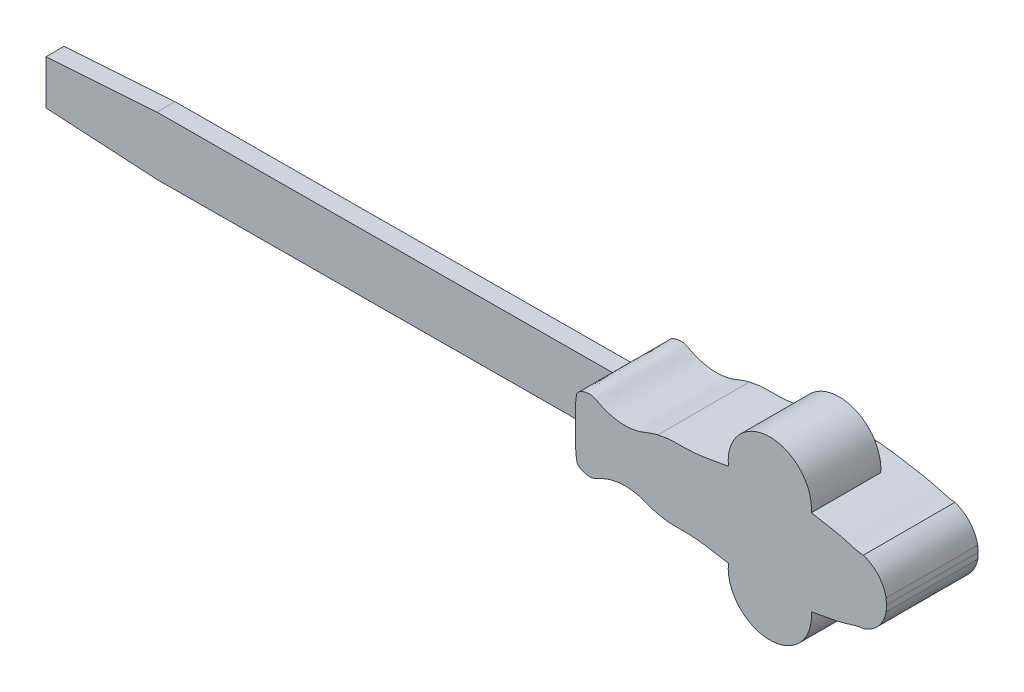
ISO-10303-21;
HEADER;
FILE_DESCRIPTION(('STEP AP214'),'2;1');
FILE_NAME('part.step','',(''),(''),'','','');
FILE_SCHEMA(('AUTOMOTIVE_DESIGN { 1 0 10303 214 1 1 1 1 }'));
ENDSEC;
DATA;
#1=APPLICATION_CONTEXT('core data for automotive mechanical design processes');
#2=APPLICATION_PROTOCOL_DEFINITION('international standard','automotive_design',2000,#1);
#3=PRODUCT_CONTEXT('',#1,'mechanical');
#4=PRODUCT('Part','Part','',(#3));
#5=PRODUCT_RELATED_PRODUCT_CATEGORY('part','',(#4));
#6=PRODUCT_DEFINITION_FORMATION('','',#4);
#7=PRODUCT_DEFINITION_CONTEXT('part definition',#1,'design');
#8=PRODUCT_DEFINITION('design','',#6,#7);
#9=PRODUCT_DEFINITION_SHAPE('','',#8);
#10=(LENGTH_UNIT() NAMED_UNIT(*) SI_UNIT(.MILLI.,.METRE.));
#11=(NAMED_UNIT(*) PLANE_ANGLE_UNIT() SI_UNIT($,.RADIAN.));
#12=(NAMED_UNIT(*) SI_UNIT($,.STERADIAN.) SOLID_ANGLE_UNIT());
#13=UNCERTAINTY_MEASURE_WITH_UNIT(LENGTH_MEASURE(1.E-05),#10,'distance_accuracy_value','');
#14=(GEOMETRIC_REPRESENTATION_CONTEXT(3) GLOBAL_UNCERTAINTY_ASSIGNED_CONTEXT((#13)) GLOBAL_UNIT_ASSIGNED_CONTEXT((#10,
#11,#12)) REPRESENTATION_CONTEXT('',''));
#15=CARTESIAN_POINT('',(0.,0.,0.));
#16=DIRECTION('',(0.,0.,1.));
#17=DIRECTION('',(1.,0.,0.));
#18=AXIS2_PLACEMENT_3D('',#15,#16,#17);
#19=CARTESIAN_POINT('',(5.05066941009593,-10.4757213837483,-3.25));
#20=DIRECTION('',(0.,0.,-1.));
#21=DIRECTION('',(-1.,0.,0.));
#22=AXIS2_PLACEMENT_3D('',#19,#20,#21);
#23=PLANE('',#22);
#24=DIRECTION('',(-0.999988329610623,-0.00483121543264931,0.));
#25=VECTOR('',#24,1.);
#26=CARTESIAN_POINT('',(5.05066941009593,-10.4757213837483,-3.25));
#27=LINE('',#26,#25);
#28=CARTESIAN_POINT('',(0.475948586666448,-10.4978231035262,-3.25));
#29=VERTEX_POINT('',#28);
#30=CARTESIAN_POINT('',(-163.946891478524,-11.2921945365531,-3.25));
#31=VERTEX_POINT('',#30);
#32=EDGE_CURVE('E233',#29,#31,#27,.T.);
#33=ORIENTED_EDGE('',*,*,#32,.T.);
#34=DIRECTION('',(-0.998342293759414,0.0575557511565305,0.));
#35=VECTOR('',#34,1.);
#36=CARTESIAN_POINT('',(4.44392236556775,-21.0001472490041,-3.25));
#37=LINE('',#36,#35);
#38=CARTESIAN_POINT('',(-203.958969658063,-8.985445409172,-3.25));
#39=VERTEX_POINT('',#38);
#40=EDGE_CURVE('E211',#31,#39,#37,.T.);
#41=ORIENTED_EDGE('',*,*,#40,.T.);
#42=DIRECTION('',(0.00483121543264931,-0.999988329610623,0.));
#43=VECTOR('',#42,1.);
#44=CARTESIAN_POINT('',(-203.946891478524,-11.485445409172,-3.25));
#45=LINE('',#44,#43);
#46=CARTESIAN_POINT('',(-204.036268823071,7.01430951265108,-3.25));
#47=VERTEX_POINT('',#46);
#48=EDGE_CURVE('E608',#47,#39,#45,.T.);
#49=ORIENTED_EDGE('',*,*,#48,.F.);
#50=DIRECTION('',(-0.997739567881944,-0.0671993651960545,0.));
#51=VECTOR('',#50,1.);
#52=CARTESIAN_POINT('',(2.93382184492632,20.9540781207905,-3.25));
#53=LINE('',#52,#51);
#54=CARTESIAN_POINT('',(-164.04834700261,9.70756038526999,-3.25));
#55=VERTEX_POINT('',#54);
#56=EDGE_CURVE('E65',#55,#47,#53,.T.);
#57=ORIENTED_EDGE('',*,*,#56,.F.);
#58=DIRECTION('',(-0.999988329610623,-0.00483121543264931,0.));
#59=VECTOR('',#58,1.);
#60=CARTESIAN_POINT('',(4.9492138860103,10.5240335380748,-3.25));
#61=LINE('',#60,#59);
#62=CARTESIAN_POINT('',(0.374493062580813,10.5019318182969,-3.25));
#63=VERTEX_POINT('',#62);
#64=EDGE_CURVE('E238',#63,#55,#61,.T.);
#65=ORIENTED_EDGE('',*,*,#64,.F.);
#66=CARTESIAN_POINT('',(-0.0328656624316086,3.40126746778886,-3.25));
#67=CARTESIAN_POINT('',(-0.224843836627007,7.16255319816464,-3.25));
#68=CARTESIAN_POINT('',(0.440236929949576,10.8822575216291,-3.25));
#69=B_SPLINE_CURVE_WITH_KNOTS('',2,(#66,#67,#68),.UNSPECIFIED.,.F.,.F.,(3,3),(0.,1.),.UNSPECIFIED.);
#70=CARTESIAN_POINT('',(-0.0328656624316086,3.40126746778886,-3.25));
#71=VERTEX_POINT('',#70);
#72=EDGE_CURVE('E271',#71,#63,#69,.T.);
#73=ORIENTED_EDGE('',*,*,#72,.F.);
#74=DIRECTION('',(-0.00966231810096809,0.999953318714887,0.));
#75=VECTOR('',#74,1.);
#76=CARTESIAN_POINT('',(0.,0.,-3.25));
#77=LINE('',#76,#75);
#78=CARTESIAN_POINT('',(0.,0.,-3.25));
#79=VERTEX_POINT('',#78);
#80=EDGE_CURVE('E585',#79,#71,#77,.T.);
#81=ORIENTED_EDGE('',*,*,#80,.F.);
#82=DIRECTION('',(0.,-1.,0.));
#83=VECTOR('',#82,1.);
#84=CARTESIAN_POINT('',(0.,0.,-3.25));
#85=LINE('',#84,#83);
#86=CARTESIAN_POINT('',(0.,-3.40142625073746,-3.25));
#87=VERTEX_POINT('',#86);
#88=EDGE_CURVE('E260',#79,#87,#85,.T.);
#89=ORIENTED_EDGE('',*,*,#88,.T.);
#90=CARTESIAN_POINT('',(0.,-3.40142625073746,-3.25));
#91=CARTESIAN_POINT('',(-0.15562647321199,-7.16439135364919,-3.25));
#92=CARTESIAN_POINT('',(0.545364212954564,-10.8774958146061,-3.25));
#93=B_SPLINE_CURVE_WITH_KNOTS('',2,(#90,#91,#92),.UNSPECIFIED.,.F.,.F.,(3,3),(0.,1.),.UNSPECIFIED.);
#94=EDGE_CURVE('E266',#87,#29,#93,.T.);
#95=ORIENTED_EDGE('',*,*,#94,.T.);
#96=EDGE_LOOP('',(#33,#41,#49,#57,#65,#73,#81,#89,#95));
#97=FACE_BOUND('',#96,.T.);
#98=ADVANCED_FACE('F41',(#97),#23,.T.);
#99=CARTESIAN_POINT('',(5.05066941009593,-10.4757213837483,3.25));
#100=DIRECTION('',(0.,0.,1.));
#101=DIRECTION('',(1.,0.,0.));
#102=AXIS2_PLACEMENT_3D('',#99,#100,#101);
#103=PLANE('',#102);
#104=DIRECTION('',(-0.00483121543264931,0.999988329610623,0.));
#105=VECTOR('',#104,1.);
#106=CARTESIAN_POINT('',(-203.946891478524,-11.485445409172,3.25));
#107=LINE('',#106,#105);
#108=CARTESIAN_POINT('',(-203.958969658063,-8.985445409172,3.25));
#109=VERTEX_POINT('',#108);
#110=CARTESIAN_POINT('',(-204.036268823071,7.01430951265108,3.25));
#111=VERTEX_POINT('',#110);
#112=EDGE_CURVE('E225',#109,#111,#107,.T.);
#113=ORIENTED_EDGE('',*,*,#112,.F.);
#114=DIRECTION('',(0.998342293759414,-0.0575557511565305,0.));
#115=VECTOR('',#114,1.);
#116=CARTESIAN_POINT('',(-203.958969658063,-8.985445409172,3.25));
#117=LINE('',#116,#115);
#118=CARTESIAN_POINT('',(-163.946891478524,-11.2921945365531,3.25));
#119=VERTEX_POINT('',#118);
#120=EDGE_CURVE('E58',#109,#119,#117,.T.);
#121=ORIENTED_EDGE('',*,*,#120,.T.);
#122=DIRECTION('',(-0.999988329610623,-0.00483121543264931,0.));
#123=VECTOR('',#122,1.);
#124=CARTESIAN_POINT('',(5.05066941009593,-10.4757213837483,3.25));
#125=LINE('',#124,#123);
#126=CARTESIAN_POINT('',(0.475948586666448,-10.4978231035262,3.25));
#127=VERTEX_POINT('',#126);
#128=EDGE_CURVE('E222',#127,#119,#125,.T.);
#129=ORIENTED_EDGE('',*,*,#128,.F.);
#130=CARTESIAN_POINT('',(0.,-3.40142625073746,3.25));
#131=CARTESIAN_POINT('',(-0.15562647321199,-7.16439135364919,3.25));
#132=CARTESIAN_POINT('',(0.545364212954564,-10.8774958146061,3.25));
#133=B_SPLINE_CURVE_WITH_KNOTS('',2,(#130,#131,#132),.UNSPECIFIED.,.F.,.F.,(3,3),(0.,1.),.UNSPECIFIED.);
#134=CARTESIAN_POINT('',(0.,-3.40142625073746,3.25));
#135=VERTEX_POINT('',#134);
#136=EDGE_CURVE('E246',#127,#135,#133,.F.);
#137=ORIENTED_EDGE('',*,*,#136,.T.);
#138=DIRECTION('',(0.,1.,0.));
#139=VECTOR('',#138,1.);
#140=CARTESIAN_POINT('',(0.,0.,3.25));
#141=LINE('',#140,#139);
#142=CARTESIAN_POINT('',(0.,0.,3.25));
#143=VERTEX_POINT('',#142);
#144=EDGE_CURVE('E243',#135,#143,#141,.T.);
#145=ORIENTED_EDGE('',*,*,#144,.T.);
#146=DIRECTION('',(0.00966231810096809,-0.999953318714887,0.));
#147=VECTOR('',#146,1.);
#148=CARTESIAN_POINT('',(0.,0.,3.25));
#149=LINE('',#148,#147);
#150=CARTESIAN_POINT('',(-0.0328656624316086,3.40126746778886,3.25));
#151=VERTEX_POINT('',#150);
#152=EDGE_CURVE('E384',#151,#143,#149,.T.);
#153=ORIENTED_EDGE('',*,*,#152,.F.);
#154=CARTESIAN_POINT('',(-0.0328656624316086,3.40126746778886,3.25));
#155=CARTESIAN_POINT('',(-0.224843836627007,7.16255319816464,3.25));
#156=CARTESIAN_POINT('',(0.440236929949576,10.8822575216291,3.25));
#157=B_SPLINE_CURVE_WITH_KNOTS('',2,(#154,#155,#156),.UNSPECIFIED.,.F.,.F.,(3,3),(0.,1.),.UNSPECIFIED.);
#158=CARTESIAN_POINT('',(0.374493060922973,10.5019318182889,3.25));
#159=VERTEX_POINT('',#158);
#160=EDGE_CURVE('E251',#159,#151,#157,.F.);
#161=ORIENTED_EDGE('',*,*,#160,.F.);
#162=DIRECTION('',(-0.999988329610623,-0.00483121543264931,0.));
#163=VECTOR('',#162,1.);
#164=CARTESIAN_POINT('',(4.9492138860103,10.5240335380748,3.25));
#165=LINE('',#164,#163);
#166=CARTESIAN_POINT('',(-164.04834700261,9.70756038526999,3.25));
#167=VERTEX_POINT('',#166);
#168=EDGE_CURVE('E232',#159,#167,#165,.T.);
#169=ORIENTED_EDGE('',*,*,#168,.T.);
#170=DIRECTION('',(0.997739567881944,0.0671993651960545,0.));
#171=VECTOR('',#170,1.);
#172=CARTESIAN_POINT('',(-204.036268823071,7.01430951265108,3.25));
#173=LINE('',#172,#171);
#174=EDGE_CURVE('E594',#111,#167,#173,.T.);
#175=ORIENTED_EDGE('',*,*,#174,.F.);
#176=EDGE_LOOP('',(#113,#121,#129,#137,#145,#153,#161,#169,#175));
#177=FACE_BOUND('',#176,.T.);
#178=ADVANCED_FACE('F221',(#177),#103,.T.);
#179=CARTESIAN_POINT('',(5.05066941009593,-10.4757213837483,3.25));
#180=DIRECTION('',(0.00483121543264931,-0.999988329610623,0.));
#181=DIRECTION('',(0.999988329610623,0.00483121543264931,0.));
#182=AXIS2_PLACEMENT_3D('',#179,#180,#181);
#183=PLANE('',#182);
#184=ORIENTED_EDGE('',*,*,#128,.T.);
#185=DIRECTION('',(0.,0.,1.));
#186=VECTOR('',#185,1.);
#187=CARTESIAN_POINT('',(-163.946891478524,-11.2921945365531,-16.5));
#188=LINE('',#187,#186);
#189=EDGE_CURVE('E208',#31,#119,#188,.T.);
#190=ORIENTED_EDGE('',*,*,#189,.F.);
#191=ORIENTED_EDGE('',*,*,#32,.F.);
#192=DIRECTION('',(0.,0.,1.));
#193=VECTOR('',#192,1.);
#194=CARTESIAN_POINT('',(0.47594858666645,-10.4978231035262,-16.5));
#195=LINE('',#194,#193);
#196=EDGE_CURVE('E230',#29,#127,#195,.T.);
#197=ORIENTED_EDGE('',*,*,#196,.T.);
#198=EDGE_LOOP('',(#184,#190,#191,#197));
#199=FACE_BOUND('',#198,.T.);
#200=ADVANCED_FACE('F228',(#199),#183,.T.);
#201=CARTESIAN_POINT('',(-203.997619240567,-0.98556794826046,0.));
#202=DIRECTION('',(-0.999988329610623,-0.00483121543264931,0.));
#203=DIRECTION('',(0.00483121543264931,-0.999988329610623,0.));
#204=AXIS2_PLACEMENT_3D('',#201,#202,#203);
#205=PLANE('',#204);
#206=ORIENTED_EDGE('',*,*,#48,.T.);
#207=DIRECTION('',(0.,0.,1.));
#208=VECTOR('',#207,1.);
#209=CARTESIAN_POINT('',(-203.958969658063,-8.985445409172,0.));
#210=LINE('',#209,#208);
#211=EDGE_CURVE('E11',#39,#109,#210,.T.);
#212=ORIENTED_EDGE('',*,*,#211,.T.);
#213=ORIENTED_EDGE('',*,*,#112,.T.);
#214=DIRECTION('',(0.,0.,1.));
#215=VECTOR('',#214,1.);
#216=CARTESIAN_POINT('',(-204.036268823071,7.01430951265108,0.));
#217=LINE('',#216,#215);
#218=EDGE_CURVE('E51',#47,#111,#217,.T.);
#219=ORIENTED_EDGE('',*,*,#218,.F.);
#220=EDGE_LOOP('',(#206,#212,#213,#219));
#221=FACE_BOUND('',#220,.T.);
#222=ADVANCED_FACE('F832',(#221),#205,.T.);
#223=CARTESIAN_POINT('',(0.,0.,-16.5));
#224=DIRECTION('',(-1.,0.,0.));
#225=DIRECTION('',(0.,0.,1.));
#226=AXIS2_PLACEMENT_3D('',#223,#224,#225);
#227=PLANE('',#226);
#228=ORIENTED_EDGE('',*,*,#88,.F.);
#229=DIRECTION('',(0.,0.,1.));
#230=VECTOR('',#229,1.);
#231=CARTESIAN_POINT('',(0.,0.,-16.5));
#232=LINE('',#231,#230);
#233=CARTESIAN_POINT('',(0.,0.,-16.5));
#234=VERTEX_POINT('',#233);
#235=EDGE_CURVE('E346',#234,#79,#232,.T.);
#236=ORIENTED_EDGE('',*,*,#235,.F.);
#237=DIRECTION('',(0.,-1.,0.));
#238=VECTOR('',#237,1.);
#239=CARTESIAN_POINT('',(0.,0.,-16.5));
#240=LINE('',#239,#238);
#241=CARTESIAN_POINT('',(0.,-3.40142625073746,-16.5));
#242=VERTEX_POINT('',#241);
#243=EDGE_CURVE('E530',#234,#242,#240,.T.);
#244=ORIENTED_EDGE('',*,*,#243,.T.);
#245=DIRECTION('',(0.,0.,1.));
#246=VECTOR('',#245,1.);
#247=CARTESIAN_POINT('',(0.,-3.40142625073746,-16.5));
#248=LINE('',#247,#246);
#249=EDGE_CURVE('E351',#242,#87,#248,.T.);
#250=ORIENTED_EDGE('',*,*,#249,.T.);
#251=EDGE_LOOP('',(#228,#236,#244,#250));
#252=FACE_BOUND('',#251,.T.);
#253=ADVANCED_FACE('F561',(#252),#227,.T.);
#254=CARTESIAN_POINT('',(0.,0.,-16.5));
#255=DIRECTION('',(0.999953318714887,0.00966231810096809,0.));
#256=DIRECTION('',(-0.00966231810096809,0.999953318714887,0.));
#257=AXIS2_PLACEMENT_3D('',#254,#255,#256);
#258=PLANE('',#257);
#259=ORIENTED_EDGE('',*,*,#235,.T.);
#260=ORIENTED_EDGE('',*,*,#80,.T.);
#261=DIRECTION('',(0.,0.,1.));
#262=VECTOR('',#261,1.);
#263=CARTESIAN_POINT('',(-0.0328656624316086,3.40126746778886,-16.5));
#264=LINE('',#263,#262);
#265=CARTESIAN_POINT('',(-0.0328656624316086,3.40126746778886,-16.5));
#266=VERTEX_POINT('',#265);
#267=EDGE_CURVE('E340',#266,#71,#264,.T.);
#268=ORIENTED_EDGE('',*,*,#267,.F.);
#269=DIRECTION('',(-0.00966231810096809,0.999953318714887,0.));
#270=VECTOR('',#269,1.);
#271=CARTESIAN_POINT('',(0.,0.,-16.5));
#272=LINE('',#271,#270);
#273=EDGE_CURVE('E524',#234,#266,#272,.T.);
#274=ORIENTED_EDGE('',*,*,#273,.F.);
#275=EDGE_LOOP('',(#259,#260,#268,#274));
#276=FACE_BOUND('',#275,.T.);
#277=ADVANCED_FACE('F564',(#276),#258,.F.);
#278=CARTESIAN_POINT('',(-0.0328656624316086,3.40126746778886,-16.5));
#279=CARTESIAN_POINT('',(-0.224843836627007,7.16255319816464,-16.5));
#280=CARTESIAN_POINT('',(0.440236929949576,10.8822575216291,-16.5));
#281=B_SPLINE_CURVE_WITH_KNOTS('',2,(#278,#279,#280),.UNSPECIFIED.,.F.,.F.,(3,3),(0.,1.),.UNSPECIFIED.);
#282=DIRECTION('',(0.,0.,1.));
#283=VECTOR('',#282,1.);
#284=SURFACE_OF_LINEAR_EXTRUSION('',#281,#283);
#285=ORIENTED_EDGE('',*,*,#267,.T.);
#286=ORIENTED_EDGE('',*,*,#72,.T.);
#287=DIRECTION('',(0.,0.,1.));
#288=VECTOR('',#287,1.);
#289=CARTESIAN_POINT('',(0.374493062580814,10.5019318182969,-16.5));
#290=LINE('',#289,#288);
#291=EDGE_CURVE('E584',#63,#159,#290,.T.);
#292=ORIENTED_EDGE('',*,*,#291,.T.);
#293=ORIENTED_EDGE('',*,*,#160,.T.);
#294=CARTESIAN_POINT('',(-0.0328656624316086,3.40126746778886,16.5));
#295=VERTEX_POINT('',#294);
#296=EDGE_CURVE('E345',#151,#295,#264,.T.);
#297=ORIENTED_EDGE('',*,*,#296,.T.);
#298=CARTESIAN_POINT('',(-0.0328656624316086,3.40126746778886,16.5));
#299=CARTESIAN_POINT('',(-0.224843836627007,7.16255319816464,16.5));
#300=CARTESIAN_POINT('',(0.440236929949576,10.8822575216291,16.5));
#301=B_SPLINE_CURVE_WITH_KNOTS('',2,(#298,#299,#300),.UNSPECIFIED.,.F.,.F.,(3,3),(0.,1.),.UNSPECIFIED.);
#302=CARTESIAN_POINT('',(0.440236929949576,10.8822575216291,16.5));
#303=VERTEX_POINT('',#302);
#304=EDGE_CURVE('E281',#295,#303,#301,.T.);
#305=ORIENTED_EDGE('',*,*,#304,.T.);
#306=DIRECTION('',(0.,0.,1.));
#307=VECTOR('',#306,1.);
#308=CARTESIAN_POINT('',(0.440236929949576,10.8822575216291,-16.5));
#309=LINE('',#308,#307);
#310=CARTESIAN_POINT('',(0.440236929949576,10.8822575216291,-16.5));
#311=VERTEX_POINT('',#310);
#312=EDGE_CURVE('E381',#311,#303,#309,.T.);
#313=ORIENTED_EDGE('',*,*,#312,.F.);
#314=EDGE_CURVE('E514',#266,#311,#281,.T.);
#315=ORIENTED_EDGE('',*,*,#314,.F.);
#316=EDGE_LOOP('',(#285,#286,#292,#293,#297,#305,#313,#315));
#317=FACE_BOUND('',#316,.T.);
#318=ADVANCED_FACE('F43',(#317),#284,.F.);
#319=CARTESIAN_POINT('',(0.440236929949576,10.8822575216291,-16.5));
#320=CARTESIAN_POINT('',(1.2545844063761,11.9870686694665,-16.5));
#321=CARTESIAN_POINT('',(3.1984745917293,12.8617459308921,-16.5));
#322=CARTESIAN_POINT('',(6.06946087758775,12.9836702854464,-16.5));
#323=CARTESIAN_POINT('',(8.10206341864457,11.9647141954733,-16.5));
#324=CARTESIAN_POINT('',(10.410042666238,10.7755542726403,-16.5));
#325=CARTESIAN_POINT('',(13.1861198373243,9.93656936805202,-16.5));
#326=CARTESIAN_POINT('',(16.5420551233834,9.38374930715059,-16.5));
#327=CARTESIAN_POINT('',(20.1718624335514,9.5213119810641,-16.5));
#328=CARTESIAN_POINT('',(24.0575079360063,10.3963118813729,-16.5));
#329=CARTESIAN_POINT('',(27.0776430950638,11.8209129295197,-16.5));
#330=CARTESIAN_POINT('',(29.0453889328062,12.3411585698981,-16.5));
#331=CARTESIAN_POINT('',(29.6585793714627,12.4932887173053,-16.5));
#332=B_SPLINE_CURVE_WITH_KNOTS('',3,(#319,#320,#321,#322,#323,#324,#325,#326,#327,#328,#329,
#330,#331),.UNSPECIFIED.,.F.,.F.,(4,1,1,1,1,1,1,1,1,1,4),(0.,0.120356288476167,
0.182103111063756,0.252493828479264,0.320379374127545,0.416926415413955,0.511670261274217,
0.625759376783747,0.741661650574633,0.867963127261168,0.924773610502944),.UNSPECIFIED.);
#333=DIRECTION('',(0.,0.,1.));
#334=VECTOR('',#333,1.);
#335=SURFACE_OF_LINEAR_EXTRUSION('',#332,#334);
#336=ORIENTED_EDGE('',*,*,#312,.T.);
#337=CARTESIAN_POINT('',(0.440236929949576,10.8822575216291,16.5));
#338=CARTESIAN_POINT('',(1.2545844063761,11.9870686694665,16.5));
#339=CARTESIAN_POINT('',(3.1984745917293,12.8617459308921,16.5));
#340=CARTESIAN_POINT('',(6.06946087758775,12.9836702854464,16.5));
#341=CARTESIAN_POINT('',(8.10206341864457,11.9647141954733,16.5));
#342=CARTESIAN_POINT('',(10.410042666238,10.7755542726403,16.5));
#343=CARTESIAN_POINT('',(13.1861198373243,9.93656936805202,16.5));
#344=CARTESIAN_POINT('',(16.5420551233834,9.38374930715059,16.5));
#345=CARTESIAN_POINT('',(20.1718624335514,9.5213119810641,16.5));
#346=CARTESIAN_POINT('',(24.0575079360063,10.3963118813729,16.5));
#347=CARTESIAN_POINT('',(27.0776430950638,11.8209129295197,16.5));
#348=CARTESIAN_POINT('',(29.0453889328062,12.3411585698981,16.5));
#349=CARTESIAN_POINT('',(29.6585793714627,12.4932887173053,16.5));
#350=B_SPLINE_CURVE_WITH_KNOTS('',3,(#337,#338,#339,#340,#341,#342,#343,#344,#345,#346,#347,
#348,#349),.UNSPECIFIED.,.F.,.F.,(4,1,1,1,1,1,1,1,1,1,4),(0.,0.120356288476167,
0.182103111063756,0.252493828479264,0.320379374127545,0.416926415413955,0.511670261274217,
0.625759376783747,0.741661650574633,0.867963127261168,0.924773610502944),.UNSPECIFIED.);
#351=CARTESIAN_POINT('',(29.6585793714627,12.4932887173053,16.5));
#352=VERTEX_POINT('',#351);
#353=EDGE_CURVE('E495',#303,#352,#350,.T.);
#354=ORIENTED_EDGE('',*,*,#353,.T.);
#355=DIRECTION('',(0.,0.,1.));
#356=VECTOR('',#355,1.);
#357=CARTESIAN_POINT('',(29.6585793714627,12.4932887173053,-16.5));
#358=LINE('',#357,#356);
#359=CARTESIAN_POINT('',(29.6585793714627,12.4932887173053,-16.5));
#360=VERTEX_POINT('',#359);
#361=EDGE_CURVE('E378',#360,#352,#358,.T.);
#362=ORIENTED_EDGE('',*,*,#361,.F.);
#363=EDGE_CURVE('E385',#311,#360,#332,.T.);
#364=ORIENTED_EDGE('',*,*,#363,.F.);
#365=EDGE_LOOP('',(#336,#354,#362,#364));
#366=FACE_BOUND('',#365,.T.);
#367=ADVANCED_FACE('F400',(#366),#335,.F.);
#368=CARTESIAN_POINT('',(29.6585793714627,12.4932887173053,-16.5));
#369=CARTESIAN_POINT('',(31.0128652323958,12.7506046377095,-16.5));
#370=CARTESIAN_POINT('',(33.0414585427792,13.2110228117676,-16.5));
#371=CARTESIAN_POINT('',(36.2612563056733,13.2560790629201,-16.5));
#372=CARTESIAN_POINT('',(39.0452583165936,13.2577644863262,-16.5));
#373=CARTESIAN_POINT('',(42.4985052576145,13.3903631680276,-16.5));
#374=CARTESIAN_POINT('',(46.0869267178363,13.7929133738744,-16.5));
#375=CARTESIAN_POINT('',(49.779062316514,14.4884361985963,-16.5));
#376=CARTESIAN_POINT('',(53.4778441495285,15.157919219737,-16.5));
#377=CARTESIAN_POINT('',(57.1168962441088,15.7270449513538,-16.5));
#378=CARTESIAN_POINT('',(60.9657898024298,16.2710657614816,-16.5));
#379=CARTESIAN_POINT('',(64.9828941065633,16.6262630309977,-16.5));
#380=CARTESIAN_POINT('',(69.1101359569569,17.0899493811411,-16.5));
#381=CARTESIAN_POINT('',(73.4451248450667,17.0625696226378,-16.5));
#382=CARTESIAN_POINT('',(77.6235824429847,16.9670082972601,-16.5));
#383=CARTESIAN_POINT('',(81.8363104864,16.3230746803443,-16.5));
#384=CARTESIAN_POINT('',(86.1669893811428,15.6372598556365,-16.5));
#385=CARTESIAN_POINT('',(91.7093018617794,14.7383170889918,-16.5));
#386=CARTESIAN_POINT('',(97.6251708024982,13.4829344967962,-16.5));
#387=CARTESIAN_POINT('',(101.818778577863,11.9447202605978,-16.5));
#388=CARTESIAN_POINT('',(103.707407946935,11.9908059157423,-16.5));
#389=B_SPLINE_CURVE_WITH_KNOTS('',3,(#368,#369,#370,#371,#372,#373,#374,#375,#376,#377,#378,
#379,#380,#381,#382,#383,#384,#385,#386,#387,#388),.UNSPECIFIED.,.F.,.F.,(4,1,1,1,1,1,1,1,1,1,1,
1,1,1,1,1,1,1,4),(0.,0.0553981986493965,0.0826774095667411,0.128818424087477,0.167035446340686,
0.221096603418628,0.273333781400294,0.317568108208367,0.371733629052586,0.420941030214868,
0.473294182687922,0.533363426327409,0.587167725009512,0.646878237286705,0.700631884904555,
0.757710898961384,0.822668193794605,0.92558882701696,1.),.UNSPECIFIED.);
#390=DIRECTION('',(0.,0.,1.));
#391=VECTOR('',#390,1.);
#392=SURFACE_OF_LINEAR_EXTRUSION('',#389,#391);
#393=CARTESIAN_POINT('',(29.6585793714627,12.4932887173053,16.5));
#394=CARTESIAN_POINT('',(31.0128652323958,12.7506046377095,16.5));
#395=CARTESIAN_POINT('',(33.0414585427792,13.2110228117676,16.5));
#396=CARTESIAN_POINT('',(36.2612563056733,13.2560790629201,16.5));
#397=CARTESIAN_POINT('',(39.0452583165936,13.2577644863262,16.5));
#398=CARTESIAN_POINT('',(42.4985052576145,13.3903631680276,16.5));
#399=CARTESIAN_POINT('',(46.0869267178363,13.7929133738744,16.5));
#400=CARTESIAN_POINT('',(49.779062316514,14.4884361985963,16.5));
#401=CARTESIAN_POINT('',(53.4778441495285,15.157919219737,16.5));
#402=CARTESIAN_POINT('',(57.1168962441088,15.7270449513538,16.5));
#403=CARTESIAN_POINT('',(60.9657898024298,16.2710657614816,16.5));
#404=CARTESIAN_POINT('',(64.9828941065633,16.6262630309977,16.5));
#405=CARTESIAN_POINT('',(69.1101359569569,17.0899493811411,16.5));
#406=CARTESIAN_POINT('',(73.4451248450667,17.0625696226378,16.5));
#407=CARTESIAN_POINT('',(77.6235824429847,16.9670082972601,16.5));
#408=CARTESIAN_POINT('',(81.8363104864,16.3230746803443,16.5));
#409=CARTESIAN_POINT('',(86.1669893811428,15.6372598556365,16.5));
#410=CARTESIAN_POINT('',(91.7093018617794,14.7383170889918,16.5));
#411=CARTESIAN_POINT('',(97.6251708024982,13.4829344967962,16.5));
#412=CARTESIAN_POINT('',(101.818778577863,11.9447202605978,16.5));
#413=CARTESIAN_POINT('',(103.707407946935,11.9908059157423,16.5));
#414=B_SPLINE_CURVE_WITH_KNOTS('',3,(#393,#394,#395,#396,#397,#398,#399,#400,#401,#402,#403,
#404,#405,#406,#407,#408,#409,#410,#411,#412,#413),.UNSPECIFIED.,.F.,.F.,(4,1,1,1,1,1,1,1,1,1,1,
1,1,1,1,1,1,1,4),(0.,0.0553981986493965,0.0826774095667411,0.128818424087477,0.167035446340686,
0.221096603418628,0.273333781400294,0.317568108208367,0.371733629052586,0.420941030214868,
0.473294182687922,0.533363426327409,0.587167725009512,0.646878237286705,0.700631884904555,
0.757710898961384,0.822668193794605,0.92558882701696,1.),.UNSPECIFIED.);
#415=CARTESIAN_POINT('',(55.0895967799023,15.4061525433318,16.5));
#416=VERTEX_POINT('',#415);
#417=EDGE_CURVE('E487',#352,#416,#414,.T.);
#418=ORIENTED_EDGE('',*,*,#417,.T.);
#419=DIRECTION('',(0.,0.,1.));
#420=VECTOR('',#419,1.);
#421=CARTESIAN_POINT('',(55.0895967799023,15.4061525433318,-8.5));
#422=LINE('',#421,#420);
#423=CARTESIAN_POINT('',(55.0895967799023,15.4061525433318,-8.5));
#424=VERTEX_POINT('',#423);
#425=EDGE_CURVE('E429',#424,#416,#422,.T.);
#426=ORIENTED_EDGE('',*,*,#425,.F.);
#427=CARTESIAN_POINT('',(55.0895967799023,15.4061525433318,-8.5));
#428=CARTESIAN_POINT('',(55.8060649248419,15.5197730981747,-8.5));
#429=CARTESIAN_POINT('',(57.7371095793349,15.8147088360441,-8.5));
#430=CARTESIAN_POINT('',(60.9657898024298,16.2710657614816,-8.5));
#431=CARTESIAN_POINT('',(64.9828941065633,16.6262630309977,-8.5));
#432=CARTESIAN_POINT('',(69.1101359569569,17.0899493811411,-8.5));
#433=CARTESIAN_POINT('',(73.4451248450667,17.0625696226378,-8.5));
#434=CARTESIAN_POINT('',(77.6235824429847,16.9670082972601,-8.5));
#435=CARTESIAN_POINT('',(81.4946798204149,16.3752943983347,-8.5));
#436=CARTESIAN_POINT('',(83.8851899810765,15.9983753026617,-8.5));
#437=CARTESIAN_POINT('',(84.9507542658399,15.8287112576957,-8.5));
#438=B_SPLINE_CURVE_WITH_KNOTS('',3,(#427,#428,#429,#430,#431,#432,#433,#434,#435,#436,#437),
.UNSPECIFIED.,.F.,.F.,(4,1,1,1,1,1,1,1,4),(0.342661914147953,0.371733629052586,
0.420941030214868,0.473294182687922,0.533363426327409,0.587167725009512,0.646878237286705,
0.700631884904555,0.743880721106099),.UNSPECIFIED.);
#439=CARTESIAN_POINT('',(84.9507542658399,15.8287112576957,-8.5));
#440=VERTEX_POINT('',#439);
#441=EDGE_CURVE('E436',#424,#440,#438,.T.);
#442=ORIENTED_EDGE('',*,*,#441,.T.);
#443=DIRECTION('',(0.,0.,1.));
#444=VECTOR('',#443,1.);
#445=CARTESIAN_POINT('',(84.9507542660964,15.828711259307,-8.5));
#446=LINE('',#445,#444);
#447=CARTESIAN_POINT('',(84.9507542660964,15.828711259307,16.5));
#448=VERTEX_POINT('',#447);
#449=EDGE_CURVE('E420',#440,#448,#446,.T.);
#450=ORIENTED_EDGE('',*,*,#449,.T.);
#451=CARTESIAN_POINT('',(103.707407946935,11.9908059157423,16.5));
#452=VERTEX_POINT('',#451);
#453=EDGE_CURVE('E496',#448,#452,#414,.T.);
#454=ORIENTED_EDGE('',*,*,#453,.T.);
#455=DIRECTION('',(0.,0.,1.));
#456=VECTOR('',#455,1.);
#457=CARTESIAN_POINT('',(103.707407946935,11.9908059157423,-16.5));
#458=LINE('',#457,#456);
#459=CARTESIAN_POINT('',(103.707407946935,11.9908059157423,-16.5));
#460=VERTEX_POINT('',#459);
#461=EDGE_CURVE('E374',#460,#452,#458,.T.);
#462=ORIENTED_EDGE('',*,*,#461,.F.);
#463=EDGE_CURVE('E391',#360,#460,#389,.T.);
#464=ORIENTED_EDGE('',*,*,#463,.F.);
#465=ORIENTED_EDGE('',*,*,#361,.T.);
#466=EDGE_LOOP('',(#418,#426,#442,#450,#454,#462,#464,#465));
#467=FACE_BOUND('',#466,.T.);
#468=ADVANCED_FACE('F404',(#467),#392,.F.);
#469=CARTESIAN_POINT('',(103.707407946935,11.9908059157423,-16.5));
#470=CARTESIAN_POINT('',(105.28126794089,11.4133673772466,-16.5));
#471=CARTESIAN_POINT('',(109.12557010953,9.28181191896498,-16.5));
#472=CARTESIAN_POINT('',(111.416904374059,5.30759409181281,-16.5));
#473=CARTESIAN_POINT('',(111.90109030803,2.73355710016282,-16.5));
#474=B_SPLINE_CURVE_WITH_KNOTS('',3,(#469,#470,#471,#472,#473),.UNSPECIFIED.,.F.,.F.,(4,1,4),
(0.,0.39082533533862,1.),.UNSPECIFIED.);
#475=DIRECTION('',(0.,0.,1.));
#476=VECTOR('',#475,1.);
#477=SURFACE_OF_LINEAR_EXTRUSION('',#474,#476);
#478=ORIENTED_EDGE('',*,*,#461,.T.);
#479=CARTESIAN_POINT('',(103.707407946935,11.9908059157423,16.5));
#480=CARTESIAN_POINT('',(105.28126794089,11.4133673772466,16.5));
#481=CARTESIAN_POINT('',(109.12557010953,9.28181191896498,16.5));
#482=CARTESIAN_POINT('',(111.416904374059,5.30759409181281,16.5));
#483=CARTESIAN_POINT('',(111.90109030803,2.73355710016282,16.5));
#484=B_SPLINE_CURVE_WITH_KNOTS('',3,(#479,#480,#481,#482,#483),.UNSPECIFIED.,.F.,.F.,(4,1,4),
(0.,0.39082533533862,1.),.UNSPECIFIED.);
#485=CARTESIAN_POINT('',(111.90109030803,2.73355710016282,16.5));
#486=VERTEX_POINT('',#485);
#487=EDGE_CURVE('E502',#452,#486,#484,.T.);
#488=ORIENTED_EDGE('',*,*,#487,.T.);
#489=DIRECTION('',(0.,0.,1.));
#490=VECTOR('',#489,1.);
#491=CARTESIAN_POINT('',(111.90109030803,2.73355710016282,-16.5));
#492=LINE('',#491,#490);
#493=CARTESIAN_POINT('',(111.90109030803,2.73355710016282,-16.5));
#494=VERTEX_POINT('',#493);
#495=EDGE_CURVE('E371',#494,#486,#492,.T.);
#496=ORIENTED_EDGE('',*,*,#495,.F.);
#497=EDGE_CURVE('E706',#460,#494,#474,.T.);
#498=ORIENTED_EDGE('',*,*,#497,.F.);
#499=EDGE_LOOP('',(#478,#488,#496,#498));
#500=FACE_BOUND('',#499,.T.);
#501=ADVANCED_FACE('F411',(#500),#477,.F.);
#502=CARTESIAN_POINT('',(112.,0.541102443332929,-16.5));
#503=CARTESIAN_POINT('',(111.994702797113,1.63754310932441,-16.5));
#504=CARTESIAN_POINT('',(111.90109030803,2.73355710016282,-16.5));
#505=B_SPLINE_CURVE_WITH_KNOTS('',2,(#502,#503,#504),.UNSPECIFIED.,.F.,.F.,(3,3),(0.5,1.),.UNSPECIFIED.);
#506=DIRECTION('',(0.,0.,1.));
#507=VECTOR('',#506,1.);
#508=SURFACE_OF_LINEAR_EXTRUSION('',#505,#507);
#509=ORIENTED_EDGE('',*,*,#495,.T.);
#510=CARTESIAN_POINT('',(112.,0.541102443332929,16.5));
#511=CARTESIAN_POINT('',(111.994702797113,1.63754310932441,16.5));
#512=CARTESIAN_POINT('',(111.90109030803,2.73355710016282,16.5));
#513=B_SPLINE_CURVE_WITH_KNOTS('',2,(#510,#511,#512),.UNSPECIFIED.,.F.,.F.,(3,3),(0.5,1.),.UNSPECIFIED.);
#514=CARTESIAN_POINT('',(112.,0.54110244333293,16.5));
#515=VERTEX_POINT('',#514);
#516=EDGE_CURVE('E737',#515,#486,#513,.T.);
#517=ORIENTED_EDGE('',*,*,#516,.F.);
#518=DIRECTION('',(0.,0.,1.));
#519=VECTOR('',#518,1.);
#520=CARTESIAN_POINT('',(112.,0.54110244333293,-16.5));
#521=LINE('',#520,#519);
#522=CARTESIAN_POINT('',(112.,0.54110244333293,-16.5));
#523=VERTEX_POINT('',#522);
#524=EDGE_CURVE('E368',#523,#515,#521,.T.);
#525=ORIENTED_EDGE('',*,*,#524,.F.);
#526=EDGE_CURVE('E708',#523,#494,#505,.T.);
#527=ORIENTED_EDGE('',*,*,#526,.T.);
#528=EDGE_LOOP('',(#509,#517,#525,#527));
#529=FACE_BOUND('',#528,.T.);
#530=ADVANCED_FACE('F726',(#529),#508,.T.);
#531=CARTESIAN_POINT('',(112.,0.541102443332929,-16.5));
#532=CARTESIAN_POINT('',(112.005297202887,-0.555338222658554,-16.5));
#533=CARTESIAN_POINT('',(111.922279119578,-1.65220556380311,-16.5));
#534=B_SPLINE_CURVE_WITH_KNOTS('',2,(#531,#532,#533),.UNSPECIFIED.,.F.,.F.,(3,3),(0.5,1.),.UNSPECIFIED.);
#535=DIRECTION('',(0.,0.,1.));
#536=VECTOR('',#535,1.);
#537=SURFACE_OF_LINEAR_EXTRUSION('',#534,#536);
#538=ORIENTED_EDGE('',*,*,#524,.T.);
#539=CARTESIAN_POINT('',(112.,0.541102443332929,16.5));
#540=CARTESIAN_POINT('',(112.005297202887,-0.555338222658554,16.5));
#541=CARTESIAN_POINT('',(111.922279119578,-1.65220556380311,16.5));
#542=B_SPLINE_CURVE_WITH_KNOTS('',2,(#539,#540,#541),.UNSPECIFIED.,.F.,.F.,(3,3),(0.5,1.),.UNSPECIFIED.);
#543=CARTESIAN_POINT('',(111.922279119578,-1.65220556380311,16.5));
#544=VERTEX_POINT('',#543);
#545=EDGE_CURVE('E743',#515,#544,#542,.T.);
#546=ORIENTED_EDGE('',*,*,#545,.T.);
#547=DIRECTION('',(0.,0.,1.));
#548=VECTOR('',#547,1.);
#549=CARTESIAN_POINT('',(111.922279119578,-1.65220556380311,-16.5));
#550=LINE('',#549,#548);
#551=CARTESIAN_POINT('',(111.922279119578,-1.65220556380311,-16.5));
#552=VERTEX_POINT('',#551);
#553=EDGE_CURVE('E365',#552,#544,#550,.T.);
#554=ORIENTED_EDGE('',*,*,#553,.F.);
#555=EDGE_CURVE('E638',#523,#552,#534,.T.);
#556=ORIENTED_EDGE('',*,*,#555,.F.);
#557=EDGE_LOOP('',(#538,#546,#554,#556));
#558=FACE_BOUND('',#557,.T.);
#559=ADVANCED_FACE('F724',(#558),#537,.F.);
#560=CARTESIAN_POINT('',(103.818425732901,-10.9881922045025,-16.5));
#561=CARTESIAN_POINT('',(105.386632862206,-10.3955734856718,-16.5));
#562=CARTESIAN_POINT('',(109.210159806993,-8.22697266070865,-16.5));
#563=CARTESIAN_POINT('',(111.462986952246,-4.23080075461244,-16.5));
#564=CARTESIAN_POINT('',(111.922279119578,-1.65220556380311,-16.5));
#565=B_SPLINE_CURVE_WITH_KNOTS('',3,(#560,#561,#562,#563,#564),.UNSPECIFIED.,.F.,.F.,(4,1,4),
(0.,0.39082533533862,1.),.UNSPECIFIED.);
#566=DIRECTION('',(0.,0.,1.));
#567=VECTOR('',#566,1.);
#568=SURFACE_OF_LINEAR_EXTRUSION('',#565,#567);
#569=ORIENTED_EDGE('',*,*,#553,.T.);
#570=CARTESIAN_POINT('',(103.818425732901,-10.9881922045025,16.5));
#571=CARTESIAN_POINT('',(105.386632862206,-10.3955734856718,16.5));
#572=CARTESIAN_POINT('',(109.210159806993,-8.22697266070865,16.5));
#573=CARTESIAN_POINT('',(111.462986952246,-4.23080075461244,16.5));
#574=CARTESIAN_POINT('',(111.922279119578,-1.65220556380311,16.5));
#575=B_SPLINE_CURVE_WITH_KNOTS('',3,(#570,#571,#572,#573,#574),.UNSPECIFIED.,.F.,.F.,(4,1,4),
(0.,0.39082533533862,1.),.UNSPECIFIED.);
#576=CARTESIAN_POINT('',(103.818425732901,-10.9881922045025,16.5));
#577=VERTEX_POINT('',#576);
#578=EDGE_CURVE('E325',#577,#544,#575,.T.);
#579=ORIENTED_EDGE('',*,*,#578,.F.);
#580=DIRECTION('',(0.,0.,1.));
#581=VECTOR('',#580,1.);
#582=CARTESIAN_POINT('',(103.818425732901,-10.9881922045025,-16.5));
#583=LINE('',#582,#581);
#584=CARTESIAN_POINT('',(103.818425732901,-10.9881922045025,-16.5));
#585=VERTEX_POINT('',#584);
#586=EDGE_CURVE('E361',#585,#577,#583,.T.);
#587=ORIENTED_EDGE('',*,*,#586,.F.);
#588=EDGE_CURVE('E634',#585,#552,#565,.T.);
#589=ORIENTED_EDGE('',*,*,#588,.T.);
#590=EDGE_LOOP('',(#569,#579,#587,#589));
#591=FACE_BOUND('',#590,.T.);
#592=ADVANCED_FACE('F654',(#591),#568,.T.);
#593=CARTESIAN_POINT('',(29.7779090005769,-12.2061348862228,-16.5));
#594=CARTESIAN_POINT('',(31.134617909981,-12.4503532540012,-16.5));
#595=CARTESIAN_POINT('',(33.1675652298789,-12.8911490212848,-16.5));
#596=CARTESIAN_POINT('',(36.3876480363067,-12.9050924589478,-16.5));
#597=CARTESIAN_POINT('',(39.1715363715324,-12.8798778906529,-16.5));
#598=CARTESIAN_POINT('',(42.6259033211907,-12.9791040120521,-16.5));
#599=CARTESIAN_POINT('',(46.2180468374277,-13.3469629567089,-16.5));
#600=CARTESIAN_POINT('',(49.9167304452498,-14.0067787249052,-16.5));
#601=CARTESIAN_POINT('',(53.6218083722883,-14.6404916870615,-16.5));
#602=CARTESIAN_POINT('',(57.2661896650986,-15.1744291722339,-16.5));
#603=CARTESIAN_POINT('',(61.1201600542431,-15.6812353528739,-16.5));
#604=CARTESIAN_POINT('',(65.1405088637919,-15.9976015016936,-16.5));
#605=CARTESIAN_POINT('',(69.2720383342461,-16.4213874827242,-16.5));
#606=CARTESIAN_POINT('',(73.6065603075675,-16.3521229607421,-16.5));
#607=CARTESIAN_POINT('',(77.7838995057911,-16.2161925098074,-16.5));
#608=CARTESIAN_POINT('',(81.9902090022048,-15.5315842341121,-16.5));
#609=CARTESIAN_POINT('',(86.3140591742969,-14.8039570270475,-16.5));
#610=CARTESIAN_POINT('',(91.8474270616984,-13.8515046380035,-16.5));
#611=CARTESIAN_POINT('',(97.7508899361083,-12.5390196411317,-16.5));
#612=CARTESIAN_POINT('',(101.929439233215,-10.9603572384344,-16.5));
#613=CARTESIAN_POINT('',(103.818425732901,-10.9881922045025,-16.5));
#614=B_SPLINE_CURVE_WITH_KNOTS('',3,(#593,#594,#595,#596,#597,#598,#599,#600,#601,#602,#603,
#604,#605,#606,#607,#608,#609,#610,#611,#612,#613),.UNSPECIFIED.,.F.,.F.,(4,1,1,1,1,1,1,1,1,1,1,
1,1,1,1,1,1,1,4),(0.,0.0553981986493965,0.0826774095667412,0.128818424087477,0.167035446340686,
0.221096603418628,0.273333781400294,0.317568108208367,0.371733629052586,0.420941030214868,
0.473294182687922,0.533363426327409,0.587167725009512,0.646878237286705,0.700631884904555,
0.757710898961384,0.822668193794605,0.92558882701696,1.),.UNSPECIFIED.);
#615=DIRECTION('',(0.,0.,1.));
#616=VECTOR('',#615,1.);
#617=SURFACE_OF_LINEAR_EXTRUSION('',#614,#616);
#618=DIRECTION('',(0.,0.,1.));
#619=VECTOR('',#618,1.);
#620=CARTESIAN_POINT('',(55.0764935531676,-14.8493703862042,-8.5));
#621=LINE('',#620,#619);
#622=CARTESIAN_POINT('',(55.0764935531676,-14.8493703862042,-8.5));
#623=VERTEX_POINT('',#622);
#624=CARTESIAN_POINT('',(55.0764935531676,-14.8493703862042,16.5));
#625=VERTEX_POINT('',#624);
#626=EDGE_CURVE('E674',#623,#625,#621,.T.);
#627=ORIENTED_EDGE('',*,*,#626,.T.);
#628=CARTESIAN_POINT('',(29.7779090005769,-12.2061348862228,16.5));
#629=CARTESIAN_POINT('',(31.134617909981,-12.4503532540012,16.5));
#630=CARTESIAN_POINT('',(33.1675652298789,-12.8911490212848,16.5));
#631=CARTESIAN_POINT('',(36.3876480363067,-12.9050924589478,16.5));
#632=CARTESIAN_POINT('',(39.1715363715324,-12.8798778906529,16.5));
#633=CARTESIAN_POINT('',(42.6259033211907,-12.9791040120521,16.5));
#634=CARTESIAN_POINT('',(46.2180468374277,-13.3469629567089,16.5));
#635=CARTESIAN_POINT('',(49.9167304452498,-14.0067787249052,16.5));
#636=CARTESIAN_POINT('',(53.6218083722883,-14.6404916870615,16.5));
#637=CARTESIAN_POINT('',(57.2661896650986,-15.1744291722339,16.5));
#638=CARTESIAN_POINT('',(61.1201600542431,-15.6812353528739,16.5));
#639=CARTESIAN_POINT('',(65.1405088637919,-15.9976015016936,16.5));
#640=CARTESIAN_POINT('',(69.2720383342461,-16.4213874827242,16.5));
#641=CARTESIAN_POINT('',(73.6065603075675,-16.3521229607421,16.5));
#642=CARTESIAN_POINT('',(77.7838995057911,-16.2161925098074,16.5));
#643=CARTESIAN_POINT('',(81.9902090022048,-15.5315842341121,16.5));
#644=CARTESIAN_POINT('',(86.3140591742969,-14.8039570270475,16.5));
#645=CARTESIAN_POINT('',(91.8474270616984,-13.8515046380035,16.5));
#646=CARTESIAN_POINT('',(97.7508899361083,-12.5390196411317,16.5));
#647=CARTESIAN_POINT('',(101.929439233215,-10.9603572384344,16.5));
#648=CARTESIAN_POINT('',(103.818425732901,-10.9881922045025,16.5));
#649=B_SPLINE_CURVE_WITH_KNOTS('',3,(#628,#629,#630,#631,#632,#633,#634,#635,#636,#637,#638,
#639,#640,#641,#642,#643,#644,#645,#646,#647,#648),.UNSPECIFIED.,.F.,.F.,(4,1,1,1,1,1,1,1,1,1,1,
1,1,1,1,1,1,1,4),(0.,0.0553981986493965,0.0826774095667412,0.128818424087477,0.167035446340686,
0.221096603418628,0.273333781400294,0.317568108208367,0.371733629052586,0.420941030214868,
0.473294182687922,0.533363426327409,0.587167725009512,0.646878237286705,0.700631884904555,
0.757710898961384,0.822668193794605,0.92558882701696,1.),.UNSPECIFIED.);
#650=CARTESIAN_POINT('',(29.7779090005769,-12.2061348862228,16.5));
#651=VERTEX_POINT('',#650);
#652=EDGE_CURVE('E336',#651,#625,#649,.T.);
#653=ORIENTED_EDGE('',*,*,#652,.F.);
#654=DIRECTION('',(0.,0.,1.));
#655=VECTOR('',#654,1.);
#656=CARTESIAN_POINT('',(29.7779090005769,-12.2061348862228,-16.5));
#657=LINE('',#656,#655);
#658=CARTESIAN_POINT('',(29.7779090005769,-12.2061348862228,-16.5));
#659=VERTEX_POINT('',#658);
#660=EDGE_CURVE('E358',#659,#651,#657,.T.);
#661=ORIENTED_EDGE('',*,*,#660,.F.);
#662=EDGE_CURVE('E630',#659,#585,#614,.T.);
#663=ORIENTED_EDGE('',*,*,#662,.T.);
#664=ORIENTED_EDGE('',*,*,#586,.T.);
#665=CARTESIAN_POINT('',(84.9410694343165,-15.0339759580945,16.5));
#666=VERTEX_POINT('',#665);
#667=EDGE_CURVE('E317',#666,#577,#649,.T.);
#668=ORIENTED_EDGE('',*,*,#667,.F.);
#669=DIRECTION('',(0.,0.,1.));
#670=VECTOR('',#669,1.);
#671=CARTESIAN_POINT('',(84.9410694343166,-15.0339759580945,-8.5));
#672=LINE('',#671,#670);
#673=CARTESIAN_POINT('',(84.9410694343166,-15.0339759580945,-8.5));
#674=VERTEX_POINT('',#673);
#675=EDGE_CURVE('E291',#674,#666,#672,.T.);
#676=ORIENTED_EDGE('',*,*,#675,.F.);
#677=CARTESIAN_POINT('',(84.9410694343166,-15.0339759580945,-8.5));
#678=CARTESIAN_POINT('',(83.9300533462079,-15.2048289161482,-8.5));
#679=CARTESIAN_POINT('',(81.5960721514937,-15.5957329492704,-8.5));
#680=CARTESIAN_POINT('',(77.7838995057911,-16.2161925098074,-8.5));
#681=CARTESIAN_POINT('',(73.6065603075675,-16.3521229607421,-8.5));
#682=CARTESIAN_POINT('',(69.2720383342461,-16.4213874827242,-8.5));
#683=CARTESIAN_POINT('',(65.1405088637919,-15.9976015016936,-8.5));
#684=CARTESIAN_POINT('',(61.1201600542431,-15.6812353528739,-8.5));
#685=CARTESIAN_POINT('',(57.8339431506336,-15.2490900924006,-8.5));
#686=CARTESIAN_POINT('',(55.8470548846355,-14.9646211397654,-8.5));
#687=CARTESIAN_POINT('',(55.0764935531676,-14.8493703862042,-8.5));
#688=B_SPLINE_CURVE_WITH_KNOTS('',3,(#677,#678,#679,#680,#681,#682,#683,#684,#685,#686,#687),
.UNSPECIFIED.,.F.,.F.,(4,1,1,1,1,1,1,1,4),(0.340509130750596,0.38160802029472,0.43536166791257,
0.495072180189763,0.548876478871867,0.608945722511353,0.661298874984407,0.710506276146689,
0.741730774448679),.UNSPECIFIED.);
#689=EDGE_CURVE('E668',#674,#623,#688,.T.);
#690=ORIENTED_EDGE('',*,*,#689,.T.);
#691=EDGE_LOOP('',(#627,#653,#661,#663,#664,#668,#676,#690));
#692=FACE_BOUND('',#691,.T.);
#693=ADVANCED_FACE('F650',(#692),#617,.T.);
#694=CARTESIAN_POINT('',(0.545364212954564,-10.8774958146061,-16.5));
#695=CARTESIAN_POINT('',(1.37034871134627,-11.9743869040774,-16.5));
#696=CARTESIAN_POINT('',(3.32259956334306,-12.8302408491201,-16.5));
#697=CARTESIAN_POINT('',(6.19462989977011,-12.9244191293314,-16.5));
#698=CARTESIAN_POINT('',(8.21729207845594,-11.8858709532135,-16.5));
#699=CARTESIAN_POINT('',(10.5136735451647,-10.6744661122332,-16.5));
#700=CARTESIAN_POINT('',(13.281514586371,-9.80869703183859,-16.5));
#701=CARTESIAN_POINT('',(16.6319516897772,-9.22347666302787,-16.5));
#702=CARTESIAN_POINT('',(20.2629187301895,-9.32596056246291,-16.5));
#703=CARTESIAN_POINT('',(24.1568373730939,-10.1633752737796,-16.5));
#704=CARTESIAN_POINT('',(27.1905964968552,-11.558728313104,-16.5));
#705=CARTESIAN_POINT('',(29.1632772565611,-12.0599366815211,-16.5));
#706=CARTESIAN_POINT('',(29.7779090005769,-12.2061348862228,-16.5));
#707=B_SPLINE_CURVE_WITH_KNOTS('',3,(#694,#695,#696,#697,#698,#699,#700,#701,#702,#703,#704,
#705,#706),.UNSPECIFIED.,.F.,.F.,(4,1,1,1,1,1,1,1,1,1,4),(0.,0.120356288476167,
0.182103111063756,0.252493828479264,0.320379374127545,0.416926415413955,0.511670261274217,
0.625759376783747,0.741661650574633,0.867963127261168,0.924773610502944),.UNSPECIFIED.);
#708=DIRECTION('',(0.,0.,1.));
#709=VECTOR('',#708,1.);
#710=SURFACE_OF_LINEAR_EXTRUSION('',#707,#709);
#711=ORIENTED_EDGE('',*,*,#660,.T.);
#712=CARTESIAN_POINT('',(0.545364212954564,-10.8774958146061,16.5));
#713=CARTESIAN_POINT('',(1.37034871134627,-11.9743869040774,16.5));
#714=CARTESIAN_POINT('',(3.32259956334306,-12.8302408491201,16.5));
#715=CARTESIAN_POINT('',(6.19462989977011,-12.9244191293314,16.5));
#716=CARTESIAN_POINT('',(8.21729207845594,-11.8858709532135,16.5));
#717=CARTESIAN_POINT('',(10.5136735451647,-10.6744661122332,16.5));
#718=CARTESIAN_POINT('',(13.281514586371,-9.80869703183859,16.5));
#719=CARTESIAN_POINT('',(16.6319516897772,-9.22347666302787,16.5));
#720=CARTESIAN_POINT('',(20.2629187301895,-9.32596056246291,16.5));
#721=CARTESIAN_POINT('',(24.1568373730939,-10.1633752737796,16.5));
#722=CARTESIAN_POINT('',(27.1905964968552,-11.558728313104,16.5));
#723=CARTESIAN_POINT('',(29.1632772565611,-12.0599366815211,16.5));
#724=CARTESIAN_POINT('',(29.7779090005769,-12.2061348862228,16.5));
#725=B_SPLINE_CURVE_WITH_KNOTS('',3,(#712,#713,#714,#715,#716,#717,#718,#719,#720,#721,#722,
#723,#724),.UNSPECIFIED.,.F.,.F.,(4,1,1,1,1,1,1,1,1,1,4),(0.,0.120356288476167,
0.182103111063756,0.252493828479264,0.320379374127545,0.416926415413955,0.511670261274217,
0.625759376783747,0.741661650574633,0.867963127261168,0.924773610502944),.UNSPECIFIED.);
#726=CARTESIAN_POINT('',(0.545364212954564,-10.8774958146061,16.5));
#727=VERTEX_POINT('',#726);
#728=EDGE_CURVE('E308',#727,#651,#725,.T.);
#729=ORIENTED_EDGE('',*,*,#728,.F.);
#730=DIRECTION('',(0.,0.,1.));
#731=VECTOR('',#730,1.);
#732=CARTESIAN_POINT('',(0.545364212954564,-10.8774958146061,-16.5));
#733=LINE('',#732,#731);
#734=CARTESIAN_POINT('',(0.545364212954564,-10.8774958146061,-16.5));
#735=VERTEX_POINT('',#734);
#736=EDGE_CURVE('E355',#735,#727,#733,.T.);
#737=ORIENTED_EDGE('',*,*,#736,.F.);
#738=EDGE_CURVE('E541',#735,#659,#707,.T.);
#739=ORIENTED_EDGE('',*,*,#738,.T.);
#740=EDGE_LOOP('',(#711,#729,#737,#739));
#741=FACE_BOUND('',#740,.T.);
#742=ADVANCED_FACE('F555',(#741),#710,.T.);
#743=CARTESIAN_POINT('',(0.,-3.40142625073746,-16.5));
#744=CARTESIAN_POINT('',(-0.15562647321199,-7.16439135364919,-16.5));
#745=CARTESIAN_POINT('',(0.545364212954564,-10.8774958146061,-16.5));
#746=B_SPLINE_CURVE_WITH_KNOTS('',2,(#743,#744,#745),.UNSPECIFIED.,.F.,.F.,(3,3),(0.,1.),.UNSPECIFIED.);
#747=DIRECTION('',(0.,0.,1.));
#748=VECTOR('',#747,1.);
#749=SURFACE_OF_LINEAR_EXTRUSION('',#746,#748);
#750=ORIENTED_EDGE('',*,*,#94,.F.);
#751=ORIENTED_EDGE('',*,*,#249,.F.);
#752=EDGE_CURVE('E534',#242,#735,#746,.T.);
#753=ORIENTED_EDGE('',*,*,#752,.T.);
#754=ORIENTED_EDGE('',*,*,#736,.T.);
#755=CARTESIAN_POINT('',(0.,-3.40142625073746,16.5));
#756=CARTESIAN_POINT('',(-0.15562647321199,-7.16439135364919,16.5));
#757=CARTESIAN_POINT('',(0.545364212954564,-10.8774958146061,16.5));
#758=B_SPLINE_CURVE_WITH_KNOTS('',2,(#755,#756,#757),.UNSPECIFIED.,.F.,.F.,(3,3),(0.,1.),.UNSPECIFIED.);
#759=CARTESIAN_POINT('',(0.,-3.40142625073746,16.5));
#760=VERTEX_POINT('',#759);
#761=EDGE_CURVE('E302',#760,#727,#758,.T.);
#762=ORIENTED_EDGE('',*,*,#761,.F.);
#763=EDGE_CURVE('E350',#135,#760,#248,.T.);
#764=ORIENTED_EDGE('',*,*,#763,.F.);
#765=ORIENTED_EDGE('',*,*,#136,.F.);
#766=ORIENTED_EDGE('',*,*,#196,.F.);
#767=EDGE_LOOP('',(#750,#751,#753,#754,#762,#764,#765,#766));
#768=FACE_BOUND('',#767,.T.);
#769=ADVANCED_FACE('F550',(#768),#749,.T.);
#770=ORIENTED_EDGE('',*,*,#144,.F.);
#771=ORIENTED_EDGE('',*,*,#763,.T.);
#772=DIRECTION('',(0.,-1.,0.));
#773=VECTOR('',#772,1.);
#774=CARTESIAN_POINT('',(0.,0.,16.5));
#775=LINE('',#774,#773);
#776=CARTESIAN_POINT('',(0.,0.,16.5));
#777=VERTEX_POINT('',#776);
#778=EDGE_CURVE('E298',#777,#760,#775,.T.);
#779=ORIENTED_EDGE('',*,*,#778,.F.);
#780=EDGE_CURVE('E344',#143,#777,#232,.T.);
#781=ORIENTED_EDGE('',*,*,#780,.F.);
#782=EDGE_LOOP('',(#770,#771,#779,#781));
#783=FACE_BOUND('',#782,.T.);
#784=ADVANCED_FACE('F554',(#783),#227,.T.);
#785=ORIENTED_EDGE('',*,*,#296,.F.);
#786=ORIENTED_EDGE('',*,*,#152,.T.);
#787=ORIENTED_EDGE('',*,*,#780,.T.);
#788=DIRECTION('',(-0.00966231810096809,0.999953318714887,0.));
#789=VECTOR('',#788,1.);
#790=CARTESIAN_POINT('',(0.,0.,16.5));
#791=LINE('',#790,#789);
#792=EDGE_CURVE('E290',#777,#295,#791,.T.);
#793=ORIENTED_EDGE('',*,*,#792,.T.);
#794=EDGE_LOOP('',(#785,#786,#787,#793));
#795=FACE_BOUND('',#794,.T.);
#796=ADVANCED_FACE('F559',(#795),#258,.F.);
#797=CARTESIAN_POINT('',(0.,0.,-16.5));
#798=DIRECTION('',(0.,0.,1.));
#799=DIRECTION('',(1.,0.,0.));
#800=AXIS2_PLACEMENT_3D('',#797,#798,#799);
#801=PLANE('',#800);
#802=ORIENTED_EDGE('',*,*,#314,.T.);
#803=ORIENTED_EDGE('',*,*,#363,.T.);
#804=ORIENTED_EDGE('',*,*,#463,.T.);
#805=ORIENTED_EDGE('',*,*,#497,.T.);
#806=ORIENTED_EDGE('',*,*,#526,.F.);
#807=ORIENTED_EDGE('',*,*,#555,.T.);
#808=ORIENTED_EDGE('',*,*,#588,.F.);
#809=ORIENTED_EDGE('',*,*,#662,.F.);
#810=ORIENTED_EDGE('',*,*,#738,.F.);
#811=ORIENTED_EDGE('',*,*,#752,.F.);
#812=ORIENTED_EDGE('',*,*,#243,.F.);
#813=ORIENTED_EDGE('',*,*,#273,.T.);
#814=EDGE_LOOP('',(#802,#803,#804,#805,#806,#807,#808,#809,#810,#811,#812,#813));
#815=FACE_BOUND('',#814,.T.);
#816=ADVANCED_FACE('F406',(#815),#801,.F.);
#817=CARTESIAN_POINT('',(0.,0.,16.5));
#818=DIRECTION('',(0.,0.,1.));
#819=DIRECTION('',(1.,0.,0.));
#820=AXIS2_PLACEMENT_3D('',#817,#818,#819);
#821=PLANE('',#820);
#822=ORIENTED_EDGE('',*,*,#304,.F.);
#823=ORIENTED_EDGE('',*,*,#792,.F.);
#824=ORIENTED_EDGE('',*,*,#778,.T.);
#825=ORIENTED_EDGE('',*,*,#761,.T.);
#826=ORIENTED_EDGE('',*,*,#728,.T.);
#827=ORIENTED_EDGE('',*,*,#652,.T.);
#828=CARTESIAN_POINT('',(70.,-16.3622997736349,16.5));
#829=DIRECTION('',(0.,0.,1.));
#830=DIRECTION('',(1.,0.,0.));
#831=AXIS2_PLACEMENT_3D('',#828,#829,#830);
#832=CIRCLE('',#831,15.);
#833=EDGE_CURVE('E442',#625,#666,#832,.T.);
#834=ORIENTED_EDGE('',*,*,#833,.T.);
#835=ORIENTED_EDGE('',*,*,#667,.T.);
#836=ORIENTED_EDGE('',*,*,#578,.T.);
#837=ORIENTED_EDGE('',*,*,#545,.F.);
#838=ORIENTED_EDGE('',*,*,#516,.T.);
#839=ORIENTED_EDGE('',*,*,#487,.F.);
#840=ORIENTED_EDGE('',*,*,#453,.F.);
#841=CARTESIAN_POINT('',(70.,17.0431851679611,16.5));
#842=DIRECTION('',(0.,0.,1.));
#843=DIRECTION('',(1.,0.,0.));
#844=AXIS2_PLACEMENT_3D('',#841,#842,#843);
#845=CIRCLE('',#844,15.);
#846=EDGE_CURVE('E280',#448,#416,#845,.T.);
#847=ORIENTED_EDGE('',*,*,#846,.T.);
#848=ORIENTED_EDGE('',*,*,#417,.F.);
#849=ORIENTED_EDGE('',*,*,#353,.F.);
#850=EDGE_LOOP('',(#822,#823,#824,#825,#826,#827,#834,#835,#836,#837,#838,#839,#840,#847,#848,#849));
#851=FACE_BOUND('',#850,.T.);
#852=ADVANCED_FACE('F568',(#851),#821,.T.);
#853=CARTESIAN_POINT('',(70.,-16.3622997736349,-8.5));
#854=DIRECTION('',(0.,0.,1.));
#855=DIRECTION('',(1.,0.,0.));
#856=AXIS2_PLACEMENT_3D('',#853,#854,#855);
#857=CYLINDRICAL_SURFACE('',#856,15.);
#858=ORIENTED_EDGE('',*,*,#833,.F.);
#859=ORIENTED_EDGE('',*,*,#626,.F.);
#860=CARTESIAN_POINT('',(70.,-16.3622997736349,-8.5));
#861=DIRECTION('',(0.,0.,1.));
#862=DIRECTION('',(1.,0.,0.));
#863=AXIS2_PLACEMENT_3D('',#860,#861,#862);
#864=CIRCLE('',#863,15.);
#865=EDGE_CURVE('E680',#623,#674,#864,.T.);
#866=ORIENTED_EDGE('',*,*,#865,.T.);
#867=ORIENTED_EDGE('',*,*,#675,.T.);
#868=EDGE_LOOP('',(#858,#859,#866,#867));
#869=FACE_BOUND('',#868,.T.);
#870=ADVANCED_FACE('F479',(#869),#857,.T.);
#871=CARTESIAN_POINT('',(70.0113852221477,-16.3625832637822,-8.5));
#872=DIRECTION('',(0.,0.,-1.));
#873=DIRECTION('',(-1.,0.,0.));
#874=AXIS2_PLACEMENT_3D('',#871,#872,#873);
#875=PLANE('',#874);
#876=ORIENTED_EDGE('',*,*,#689,.F.);
#877=ORIENTED_EDGE('',*,*,#865,.F.);
#878=EDGE_LOOP('',(#876,#877));
#879=FACE_BOUND('',#878,.T.);
#880=ADVANCED_FACE('F474',(#879),#875,.T.);
#881=CARTESIAN_POINT('',(70.,17.0431851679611,-8.5));
#882=DIRECTION('',(0.,0.,1.));
#883=DIRECTION('',(1.,0.,0.));
#884=AXIS2_PLACEMENT_3D('',#881,#882,#883);
#885=CYLINDRICAL_SURFACE('',#884,15.);
#886=ORIENTED_EDGE('',*,*,#846,.F.);
#887=ORIENTED_EDGE('',*,*,#449,.F.);
#888=CARTESIAN_POINT('',(70.,17.0431851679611,-8.5));
#889=DIRECTION('',(0.,0.,1.));
#890=DIRECTION('',(1.,0.,0.));
#891=AXIS2_PLACEMENT_3D('',#888,#889,#890);
#892=CIRCLE('',#891,15.);
#893=EDGE_CURVE('E430',#440,#424,#892,.T.);
#894=ORIENTED_EDGE('',*,*,#893,.T.);
#895=ORIENTED_EDGE('',*,*,#425,.T.);
#896=EDGE_LOOP('',(#886,#887,#894,#895));
#897=FACE_BOUND('',#896,.T.);
#898=ADVANCED_FACE('F470',(#897),#885,.T.);
#899=CARTESIAN_POINT('',(70.0108902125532,17.0435196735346,-8.5));
#900=DIRECTION('',(0.,0.,1.));
#901=DIRECTION('',(1.,0.,0.));
#902=AXIS2_PLACEMENT_3D('',#899,#900,#901);
#903=PLANE('',#902);
#904=ORIENTED_EDGE('',*,*,#441,.F.);
#905=ORIENTED_EDGE('',*,*,#893,.F.);
#906=EDGE_LOOP('',(#904,#905));
#907=FACE_BOUND('',#906,.T.);
#908=ADVANCED_FACE('F459',(#907),#903,.F.);
#909=CARTESIAN_POINT('',(4.9492138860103,10.5240335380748,3.25));
#910=DIRECTION('',(-0.00483121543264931,0.999988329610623,0.));
#911=DIRECTION('',(-0.999988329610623,-0.00483121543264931,0.));
#912=AXIS2_PLACEMENT_3D('',#909,#910,#911);
#913=PLANE('',#912);
#914=DIRECTION('',(0.,0.,1.));
#915=VECTOR('',#914,1.);
#916=CARTESIAN_POINT('',(-164.04834700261,9.70756038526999,-16.5));
#917=LINE('',#916,#915);
#918=EDGE_CURVE('E599',#55,#167,#917,.T.);
#919=ORIENTED_EDGE('',*,*,#918,.T.);
#920=ORIENTED_EDGE('',*,*,#168,.F.);
#921=ORIENTED_EDGE('',*,*,#291,.F.);
#922=ORIENTED_EDGE('',*,*,#64,.T.);
#923=EDGE_LOOP('',(#919,#920,#921,#922));
#924=FACE_BOUND('',#923,.T.);
#925=ADVANCED_FACE('F469',(#924),#913,.T.);
#926=CARTESIAN_POINT('',(-204.036268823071,7.01430951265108,-16.5));
#927=DIRECTION('',(0.0671993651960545,-0.997739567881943,0.));
#928=DIRECTION('',(0.997739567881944,0.0671993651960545,0.));
#929=AXIS2_PLACEMENT_3D('',#926,#927,#928);
#930=PLANE('',#929);
#931=ORIENTED_EDGE('',*,*,#56,.T.);
#932=ORIENTED_EDGE('',*,*,#218,.T.);
#933=ORIENTED_EDGE('',*,*,#174,.T.);
#934=ORIENTED_EDGE('',*,*,#918,.F.);
#935=EDGE_LOOP('',(#931,#932,#933,#934));
#936=FACE_BOUND('',#935,.T.);
#937=ADVANCED_FACE('F593',(#936),#930,.F.);
#938=CARTESIAN_POINT('',(-203.958969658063,-8.985445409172,-16.5));
#939=DIRECTION('',(-0.0575557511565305,-0.998342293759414,0.));
#940=DIRECTION('',(0.998342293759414,-0.0575557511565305,0.));
#941=AXIS2_PLACEMENT_3D('',#938,#939,#940);
#942=PLANE('',#941);
#943=ORIENTED_EDGE('',*,*,#189,.T.);
#944=ORIENTED_EDGE('',*,*,#120,.F.);
#945=ORIENTED_EDGE('',*,*,#211,.F.);
#946=ORIENTED_EDGE('',*,*,#40,.F.);
#947=EDGE_LOOP('',(#943,#944,#945,#946));
#948=FACE_BOUND('',#947,.T.);
#949=ADVANCED_FACE('F209',(#948),#942,.T.);
#950=CLOSED_SHELL('',(#98,#178,#200,#222,#253,#277,#318,#367,#468,#501,#530,#559,#592,#693,#742,
#769,#784,#796,#816,#852,#870,#880,#898,#908,#925,#937,#949));
#951=MANIFOLD_SOLID_BREP('B2',#950);
#952=ADVANCED_BREP_SHAPE_REPRESENTATION('',(#18,#951),#14);
#953=SHAPE_DEFINITION_REPRESENTATION(#9,#952);
ENDSEC;
END-ISO-10303-21;
